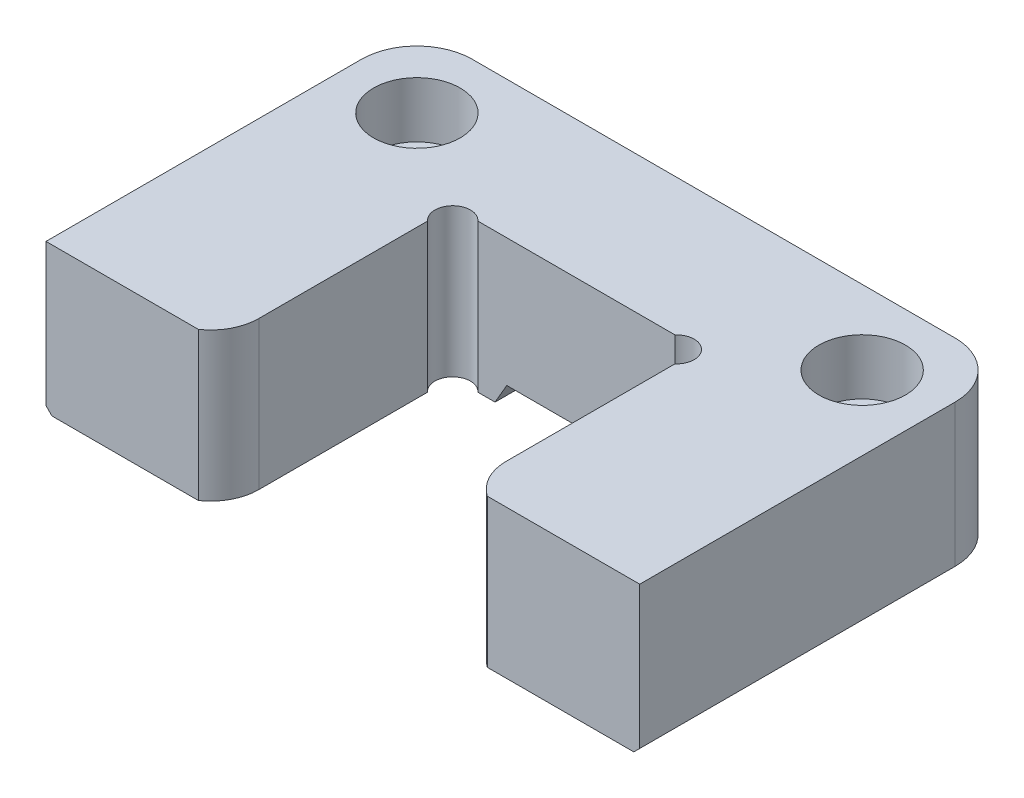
from build123d import *

# Parameters (mm, degrees)
BOSS_EXTRUDE1_DEPTH     = 19.0246
FILLET1_R               = 7.112
CUT_EXTRUDE1_DEPTH      = 64.8691422
SKETCH3_R               = 2.286
CUT_EXTRUDE2_DEPTH      = 64.8691422
CUT_EXTRUDE3_DEPTH      = 64.8691422
CHAMFER1_SIZE           = 0.762
CHAMFER5_SIZE           = 3.81
CHAMFER5_SIZE2          = 1.020886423
F_1_4_CBORE_D           = 6.5278
F_1_4_CBORE_CBORE_D     = 11.1125
F_1_4_CBORE_CBORE_DEPTH = 7.14375


with BuildPart() as part:
    # Sketch1 → Boss-Extrude1 (new body)
    with BuildSketch(Plane(origin=(0, 0, 0), x_dir=(1, 0, 0), z_dir=(0, 1, 0))):
        Polygon((15.875, 0), (38.1, 0), (38.1, 47.5996), (-38.1, 47.5996), (-38.1, 0), (-15.875, 0), (-15.875, 29.972), (15.875, 29.972), align=None)
    extrude(amount=-BOSS_EXTRUDE1_DEPTH)

    # Fillet1
    fillet1_edges = [part.edges().sort_by_distance(p)[0] for p in [
        (-38.1, -9.5123, -47.5996),
        (38.1, -9.5123, -47.5996),
    ]]
    fillet(fillet1_edges, radius=FILLET1_R)

    # Sketch2 → Cut-Extrude1 (cut, through all)
    with BuildSketch(Plane(origin=(0, 0, 0), x_dir=(1, 0, 0), z_dir=(0, 1, 0))):
        with BuildLine():
            Line((-15.875, 5.08), (-15.875, 12.7))
            Line((-15.875, 12.7), (15.875, 12.7))
            Line((15.875, 12.7), (15.875, 5.08))
            ThreePointArc((15.875, 5.08), (16.582512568, 2.211046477), (18.54280383, 0))
            Line((18.54280383, 0), (28.575, 0))
            Line((28.575, 0), (28.575, -12.7))
            Line((28.575, -12.7), (-28.575, -12.7))
            Line((-28.575, -12.7), (-28.575, 0))
            Line((-28.575, 0), (-18.54280383, 0))
            ThreePointArc((-18.54280383, 0), (-16.582512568, 2.211046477), (-15.875, 5.08))
        make_face()
    extrude(amount=-CUT_EXTRUDE1_DEPTH, mode=Mode.SUBTRACT)

    # Sketch3 → Cut-Extrude2 (cut, through all)
    with BuildSketch(Plane(origin=(0, 0, 0), x_dir=(1, 0, 0), z_dir=(0, 1, 0))):
        with Locations((-14.351, 28.448)):
            Circle(SKETCH3_R)
        with Locations((14.351, 28.448)):
            Circle(SKETCH3_R)
    extrude(amount=-CUT_EXTRUDE2_DEPTH, mode=Mode.SUBTRACT)

    # Sketch5 → Cut-Extrude3 (cut, through all)
    with BuildSketch(Plane(origin=(0, 0, -47.5996), x_dir=(-1, 0, 0), z_dir=(0, 0, -1))):
        Polygon((-9.525, -17.4371), (9.525, -17.4371), (10.441543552, -19.0246), (-10.441543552, -19.0246), align=None)
    extrude(amount=-CUT_EXTRUDE3_DEPTH, mode=Mode.SUBTRACT)

    # Chamfer1
    chamfer1_edges = [part.edges().sort_by_distance(p)[0] for p in [
        (38.1, -19.0246, -20.2438),
        (20.714771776, -19.0246, -47.5996),
        (-38.1, -19.0246, -20.2438),
        (-36.016943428, -19.0246, -45.516543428),
        (36.016943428, -19.0246, -45.516543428),
        (-20.714771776, -19.0246, -47.5996),
    ]]
    chamfer(chamfer1_edges, length=CHAMFER1_SIZE)

    # Chamfer5
    chamfer5_edges = [part.edges().sort_by_distance(p)[0] for p in [
        (0, -17.4371, -29.972),
    ]]
    chamfer5_side = [part.faces().sort_by_distance(p)[0] for p in [
        (0, -17.4371, -38.7858),
    ]]
    chamfer(chamfer5_edges, length=CHAMFER5_SIZE, length2=CHAMFER5_SIZE2, reference=chamfer5_side[0])

    # 1_4_ CBORE (through all)
    with Locations(Plane(origin=(9.083120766, 0, -5.226040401), x_dir=(-1, 0, 0), z_dir=(0, 1, 0))):
        with Locations((37.658120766, -32.848559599), (-19.491879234, -32.848559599)):
            CounterBoreHole(F_1_4_CBORE_D / 2, F_1_4_CBORE_CBORE_D / 2, F_1_4_CBORE_CBORE_DEPTH)


solid = part.part
